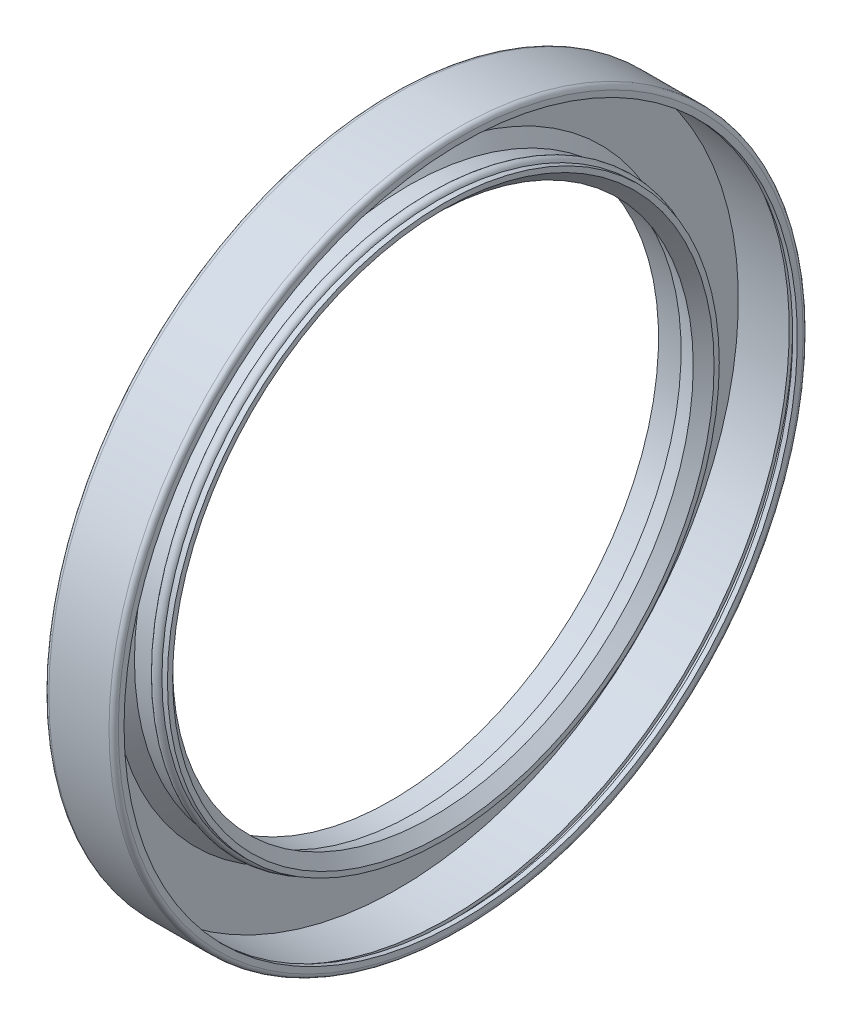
ISO-10303-21;
HEADER;
FILE_DESCRIPTION(('STEP AP214'),'2;1');
FILE_NAME('part.step','',(''),(''),'','','');
FILE_SCHEMA(('AUTOMOTIVE_DESIGN { 1 0 10303 214 1 1 1 1 }'));
ENDSEC;
DATA;
#1=APPLICATION_CONTEXT('core data for automotive mechanical design processes');
#2=APPLICATION_PROTOCOL_DEFINITION('international standard','automotive_design',2000,#1);
#3=PRODUCT_CONTEXT('',#1,'mechanical');
#4=PRODUCT('Part','Part','',(#3));
#5=PRODUCT_RELATED_PRODUCT_CATEGORY('part','',(#4));
#6=PRODUCT_DEFINITION_FORMATION('','',#4);
#7=PRODUCT_DEFINITION_CONTEXT('part definition',#1,'design');
#8=PRODUCT_DEFINITION('design','',#6,#7);
#9=PRODUCT_DEFINITION_SHAPE('','',#8);
#10=(LENGTH_UNIT() NAMED_UNIT(*) SI_UNIT(.MILLI.,.METRE.));
#11=(NAMED_UNIT(*) PLANE_ANGLE_UNIT() SI_UNIT($,.RADIAN.));
#12=(NAMED_UNIT(*) SI_UNIT($,.STERADIAN.) SOLID_ANGLE_UNIT());
#13=UNCERTAINTY_MEASURE_WITH_UNIT(LENGTH_MEASURE(1.E-05),#10,'distance_accuracy_value','');
#14=(GEOMETRIC_REPRESENTATION_CONTEXT(3) GLOBAL_UNCERTAINTY_ASSIGNED_CONTEXT((#13)) GLOBAL_UNIT_ASSIGNED_CONTEXT((#10,
#11,#12)) REPRESENTATION_CONTEXT('',''));
#15=CARTESIAN_POINT('',(0.,0.,0.));
#16=DIRECTION('',(0.,0.,1.));
#17=DIRECTION('',(1.,0.,0.));
#18=AXIS2_PLACEMENT_3D('',#15,#16,#17);
#19=CARTESIAN_POINT('',(0.,0.,-30.8));
#20=DIRECTION('',(1.,0.,0.));
#21=DIRECTION('',(0.,0.,-1.));
#22=AXIS2_PLACEMENT_3D('',#19,#20,#21);
#23=PLANE('',#22);
#24=CARTESIAN_POINT('',(0.,0.,0.));
#25=DIRECTION('',(-1.,0.,0.));
#26=DIRECTION('',(0.,0.,1.));
#27=AXIS2_PLACEMENT_3D('',#24,#25,#26);
#28=CIRCLE('',#27,39.4666666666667);
#29=CARTESIAN_POINT('',(0.,0.,39.4666666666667));
#30=VERTEX_POINT('',#29);
#31=EDGE_CURVE('E69',#30,#30,#28,.T.);
#32=ORIENTED_EDGE('',*,*,#31,.T.);
#33=EDGE_LOOP('',(#32));
#34=FACE_BOUND('',#33,.T.);
#35=CARTESIAN_POINT('',(0.,0.,0.));
#36=DIRECTION('',(1.,0.,0.));
#37=DIRECTION('',(0.,0.,-1.));
#38=AXIS2_PLACEMENT_3D('',#35,#36,#37);
#39=CIRCLE('',#38,31.2);
#40=CARTESIAN_POINT('',(0.,0.,-31.2));
#41=VERTEX_POINT('',#40);
#42=EDGE_CURVE('E10',#41,#41,#39,.F.);
#43=ORIENTED_EDGE('',*,*,#42,.F.);
#44=EDGE_LOOP('',(#43));
#45=FACE_BOUND('',#44,.T.);
#46=ADVANCED_FACE('F31',(#34,#45),#23,.F.);
#47=CARTESIAN_POINT('',(0.,0.,0.));
#48=DIRECTION('',(-1.,0.,0.));
#49=DIRECTION('',(0.,0.,1.));
#50=AXIS2_PLACEMENT_3D('',#47,#48,#49);
#51=CYLINDRICAL_SURFACE('',#50,39.2);
#52=CARTESIAN_POINT('',(6.66666666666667,0.,0.));
#53=DIRECTION('',(-1.,0.,0.));
#54=DIRECTION('',(0.,0.,1.));
#55=AXIS2_PLACEMENT_3D('',#52,#53,#54);
#56=CIRCLE('',#55,39.2);
#57=CARTESIAN_POINT('',(6.66666666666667,0.,39.2));
#58=VERTEX_POINT('',#57);
#59=EDGE_CURVE('E39',#58,#58,#56,.T.);
#60=ORIENTED_EDGE('',*,*,#59,.F.);
#61=EDGE_LOOP('',(#60));
#62=FACE_BOUND('',#61,.T.);
#63=CARTESIAN_POINT('',(0.799999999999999,0.,0.));
#64=DIRECTION('',(-1.,0.,0.));
#65=DIRECTION('',(0.,0.,1.));
#66=AXIS2_PLACEMENT_3D('',#63,#64,#65);
#67=CIRCLE('',#66,39.2);
#68=CARTESIAN_POINT('',(0.799999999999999,0.,39.2));
#69=VERTEX_POINT('',#68);
#70=EDGE_CURVE('E99',#69,#69,#67,.T.);
#71=ORIENTED_EDGE('',*,*,#70,.T.);
#72=EDGE_LOOP('',(#71));
#73=FACE_BOUND('',#72,.T.);
#74=ADVANCED_FACE('F33',(#62,#73),#51,.F.);
#75=CARTESIAN_POINT('',(6.66666666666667,0.,-39.2));
#76=DIRECTION('',(-1.,0.,0.));
#77=DIRECTION('',(0.,0.,1.));
#78=AXIS2_PLACEMENT_3D('',#75,#76,#77);
#79=PLANE('',#78);
#80=CARTESIAN_POINT('',(6.66666666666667,0.,0.));
#81=DIRECTION('',(-1.,0.,0.));
#82=DIRECTION('',(0.,0.,1.));
#83=AXIS2_PLACEMENT_3D('',#80,#81,#82);
#84=CIRCLE('',#83,39.6);
#85=CARTESIAN_POINT('',(6.66666666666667,0.,39.6));
#86=VERTEX_POINT('',#85);
#87=EDGE_CURVE('E45',#86,#86,#84,.T.);
#88=ORIENTED_EDGE('',*,*,#87,.F.);
#89=EDGE_LOOP('',(#88));
#90=FACE_BOUND('',#89,.T.);
#91=ORIENTED_EDGE('',*,*,#59,.T.);
#92=EDGE_LOOP('',(#91));
#93=FACE_BOUND('',#92,.T.);
#94=ADVANCED_FACE('F173',(#90,#93),#79,.F.);
#95=CARTESIAN_POINT('',(0.,0.,0.));
#96=DIRECTION('',(-1.,0.,0.));
#97=DIRECTION('',(0.,0.,1.));
#98=AXIS2_PLACEMENT_3D('',#95,#96,#97);
#99=CYLINDRICAL_SURFACE('',#98,39.6);
#100=CARTESIAN_POINT('',(7.46666666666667,0.,0.));
#101=DIRECTION('',(-1.,0.,0.));
#102=DIRECTION('',(0.,0.,1.));
#103=AXIS2_PLACEMENT_3D('',#100,#101,#102);
#104=CIRCLE('',#103,39.6);
#105=CARTESIAN_POINT('',(7.46666666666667,0.,39.6));
#106=VERTEX_POINT('',#105);
#107=EDGE_CURVE('E49',#106,#106,#104,.T.);
#108=ORIENTED_EDGE('',*,*,#107,.F.);
#109=EDGE_LOOP('',(#108));
#110=FACE_BOUND('',#109,.T.);
#111=ORIENTED_EDGE('',*,*,#87,.T.);
#112=EDGE_LOOP('',(#111));
#113=FACE_BOUND('',#112,.T.);
#114=ADVANCED_FACE('F206',(#110,#113),#99,.F.);
#115=CARTESIAN_POINT('',(7.46666666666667,0.,-39.6));
#116=DIRECTION('',(1.,0.,0.));
#117=DIRECTION('',(0.,0.,-1.));
#118=AXIS2_PLACEMENT_3D('',#115,#116,#117);
#119=PLANE('',#118);
#120=CARTESIAN_POINT('',(7.46666666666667,0.,0.));
#121=DIRECTION('',(-1.,0.,0.));
#122=DIRECTION('',(0.,0.,1.));
#123=AXIS2_PLACEMENT_3D('',#120,#121,#122);
#124=CIRCLE('',#123,38.8);
#125=CARTESIAN_POINT('',(7.46666666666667,0.,38.8));
#126=VERTEX_POINT('',#125);
#127=EDGE_CURVE('E54',#126,#126,#124,.T.);
#128=ORIENTED_EDGE('',*,*,#127,.F.);
#129=EDGE_LOOP('',(#128));
#130=FACE_BOUND('',#129,.T.);
#131=ORIENTED_EDGE('',*,*,#107,.T.);
#132=EDGE_LOOP('',(#131));
#133=FACE_BOUND('',#132,.T.);
#134=ADVANCED_FACE('F200',(#130,#133),#119,.F.);
#135=CARTESIAN_POINT('',(0.,0.,0.));
#136=DIRECTION('',(-1.,0.,0.));
#137=DIRECTION('',(0.,0.,1.));
#138=AXIS2_PLACEMENT_3D('',#135,#136,#137);
#139=CYLINDRICAL_SURFACE('',#138,38.8);
#140=CARTESIAN_POINT('',(8.,0.,0.));
#141=DIRECTION('',(-1.,0.,0.));
#142=DIRECTION('',(0.,0.,1.));
#143=AXIS2_PLACEMENT_3D('',#140,#141,#142);
#144=CIRCLE('',#143,38.8);
#145=CARTESIAN_POINT('',(8.,0.,38.8));
#146=VERTEX_POINT('',#145);
#147=EDGE_CURVE('E57',#146,#146,#144,.T.);
#148=ORIENTED_EDGE('',*,*,#147,.F.);
#149=EDGE_LOOP('',(#148));
#150=FACE_BOUND('',#149,.T.);
#151=ORIENTED_EDGE('',*,*,#127,.T.);
#152=EDGE_LOOP('',(#151));
#153=FACE_BOUND('',#152,.T.);
#154=ADVANCED_FACE('F194',(#150,#153),#139,.F.);
#155=CARTESIAN_POINT('',(8.,0.,-38.8));
#156=DIRECTION('',(-1.,0.,0.));
#157=DIRECTION('',(0.,0.,1.));
#158=AXIS2_PLACEMENT_3D('',#155,#156,#157);
#159=PLANE('',#158);
#160=CARTESIAN_POINT('',(8.,0.,0.));
#161=DIRECTION('',(-1.,0.,0.));
#162=DIRECTION('',(0.,0.,1.));
#163=AXIS2_PLACEMENT_3D('',#160,#161,#162);
#164=CIRCLE('',#163,39.4666666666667);
#165=CARTESIAN_POINT('',(8.,0.,39.4666666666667));
#166=VERTEX_POINT('',#165);
#167=EDGE_CURVE('E60',#166,#166,#164,.T.);
#168=ORIENTED_EDGE('',*,*,#167,.F.);
#169=EDGE_LOOP('',(#168));
#170=FACE_BOUND('',#169,.T.);
#171=ORIENTED_EDGE('',*,*,#147,.T.);
#172=EDGE_LOOP('',(#171));
#173=FACE_BOUND('',#172,.T.);
#174=ADVANCED_FACE('F188',(#170,#173),#159,.F.);
#175=CARTESIAN_POINT('',(7.46666666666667,0.,0.));
#176=DIRECTION('',(-1.,0.,0.));
#177=DIRECTION('',(0.,0.,1.));
#178=AXIS2_PLACEMENT_3D('',#175,#176,#177);
#179=TOROIDAL_SURFACE('',#178,39.4666666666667,0.533333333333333);
#180=CARTESIAN_POINT('',(7.46666666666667,0.,0.));
#181=DIRECTION('',(-1.,0.,0.));
#182=DIRECTION('',(0.,0.,1.));
#183=AXIS2_PLACEMENT_3D('',#180,#181,#182);
#184=CIRCLE('',#183,40.);
#185=CARTESIAN_POINT('',(7.46666666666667,0.,40.));
#186=VERTEX_POINT('',#185);
#187=EDGE_CURVE('E63',#186,#186,#184,.T.);
#188=ORIENTED_EDGE('',*,*,#187,.F.);
#189=EDGE_LOOP('',(#188));
#190=FACE_BOUND('',#189,.T.);
#191=ORIENTED_EDGE('',*,*,#167,.T.);
#192=EDGE_LOOP('',(#191));
#193=FACE_BOUND('',#192,.T.);
#194=ADVANCED_FACE('F182',(#190,#193),#179,.T.);
#195=CARTESIAN_POINT('',(0.,0.,0.));
#196=DIRECTION('',(-1.,0.,0.));
#197=DIRECTION('',(0.,0.,1.));
#198=AXIS2_PLACEMENT_3D('',#195,#196,#197);
#199=CYLINDRICAL_SURFACE('',#198,40.);
#200=CARTESIAN_POINT('',(0.533333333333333,0.,0.));
#201=DIRECTION('',(-1.,0.,0.));
#202=DIRECTION('',(0.,0.,1.));
#203=AXIS2_PLACEMENT_3D('',#200,#201,#202);
#204=CIRCLE('',#203,40.);
#205=CARTESIAN_POINT('',(0.533333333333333,0.,40.));
#206=VERTEX_POINT('',#205);
#207=EDGE_CURVE('E66',#206,#206,#204,.T.);
#208=ORIENTED_EDGE('',*,*,#207,.F.);
#209=EDGE_LOOP('',(#208));
#210=FACE_BOUND('',#209,.T.);
#211=ORIENTED_EDGE('',*,*,#187,.T.);
#212=EDGE_LOOP('',(#211));
#213=FACE_BOUND('',#212,.T.);
#214=ADVANCED_FACE('F165',(#210,#213),#199,.T.);
#215=CARTESIAN_POINT('',(0.533333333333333,0.,0.));
#216=DIRECTION('',(-1.,0.,0.));
#217=DIRECTION('',(0.,0.,1.));
#218=AXIS2_PLACEMENT_3D('',#215,#216,#217);
#219=TOROIDAL_SURFACE('',#218,39.4666666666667,0.533333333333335);
#220=ORIENTED_EDGE('',*,*,#31,.F.);
#221=EDGE_LOOP('',(#220));
#222=FACE_BOUND('',#221,.T.);
#223=ORIENTED_EDGE('',*,*,#207,.T.);
#224=EDGE_LOOP('',(#223));
#225=FACE_BOUND('',#224,.T.);
#226=ADVANCED_FACE('F160',(#222,#225),#219,.T.);
#227=ORIENTED_EDGE('',*,*,#42,.T.);
#228=EDGE_LOOP('',(#227));
#229=FACE_BOUND('',#228,.T.);
#230=CARTESIAN_POINT('',(0.,0.,0.));
#231=DIRECTION('',(-1.,0.,0.));
#232=DIRECTION('',(0.,0.,1.));
#233=AXIS2_PLACEMENT_3D('',#230,#231,#232);
#234=CIRCLE('',#233,30.8);
#235=CARTESIAN_POINT('',(0.,0.,30.8));
#236=VERTEX_POINT('',#235);
#237=EDGE_CURVE('E72',#236,#236,#234,.T.);
#238=ORIENTED_EDGE('',*,*,#237,.F.);
#239=EDGE_LOOP('',(#238));
#240=FACE_BOUND('',#239,.T.);
#241=ADVANCED_FACE('F155',(#229,#240),#23,.F.);
#242=CARTESIAN_POINT('',(0.,0.,0.));
#243=DIRECTION('',(-1.,0.,0.));
#244=DIRECTION('',(0.,0.,1.));
#245=AXIS2_PLACEMENT_3D('',#242,#243,#244);
#246=CYLINDRICAL_SURFACE('',#245,30.8);
#247=CARTESIAN_POINT('',(2.6020180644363,0.,0.));
#248=DIRECTION('',(-1.,0.,0.));
#249=DIRECTION('',(0.,0.,1.));
#250=AXIS2_PLACEMENT_3D('',#247,#248,#249);
#251=CIRCLE('',#250,30.8);
#252=CARTESIAN_POINT('',(2.6020180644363,0.,30.8));
#253=VERTEX_POINT('',#252);
#254=EDGE_CURVE('E75',#253,#253,#251,.T.);
#255=ORIENTED_EDGE('',*,*,#254,.F.);
#256=EDGE_LOOP('',(#255));
#257=FACE_BOUND('',#256,.T.);
#258=ORIENTED_EDGE('',*,*,#237,.T.);
#259=EDGE_LOOP('',(#258));
#260=FACE_BOUND('',#259,.T.);
#261=ADVANCED_FACE('F149',(#257,#260),#246,.F.);
#262=CARTESIAN_POINT('',(2.6020180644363,0.,0.));
#263=DIRECTION('',(-1.,0.,0.));
#264=DIRECTION('',(0.,0.,1.));
#265=AXIS2_PLACEMENT_3D('',#262,#263,#264);
#266=CONICAL_SURFACE('',#265,30.8,0.349065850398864);
#267=CARTESIAN_POINT('',(4.8,0.,0.));
#268=DIRECTION('',(-1.,0.,0.));
#269=DIRECTION('',(0.,0.,1.));
#270=AXIS2_PLACEMENT_3D('',#267,#268,#269);
#271=CIRCLE('',#270,30.);
#272=CARTESIAN_POINT('',(4.8,0.,30.));
#273=VERTEX_POINT('',#272);
#274=EDGE_CURVE('E78',#273,#273,#271,.T.);
#275=ORIENTED_EDGE('',*,*,#274,.F.);
#276=EDGE_LOOP('',(#275));
#277=FACE_BOUND('',#276,.T.);
#278=ORIENTED_EDGE('',*,*,#254,.T.);
#279=EDGE_LOOP('',(#278));
#280=FACE_BOUND('',#279,.T.);
#281=ADVANCED_FACE('F143',(#277,#280),#266,.F.);
#282=CARTESIAN_POINT('',(4.8,0.,0.));
#283=DIRECTION('',(1.,0.,0.));
#284=DIRECTION('',(0.,0.,-1.));
#285=AXIS2_PLACEMENT_3D('',#282,#283,#284);
#286=CONICAL_SURFACE('',#285,30.,0.785398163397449);
#287=CARTESIAN_POINT('',(6.,0.,0.));
#288=DIRECTION('',(-1.,0.,0.));
#289=DIRECTION('',(0.,0.,1.));
#290=AXIS2_PLACEMENT_3D('',#287,#288,#289);
#291=CIRCLE('',#290,31.2);
#292=CARTESIAN_POINT('',(6.,0.,31.2));
#293=VERTEX_POINT('',#292);
#294=EDGE_CURVE('E81',#293,#293,#291,.T.);
#295=ORIENTED_EDGE('',*,*,#294,.F.);
#296=EDGE_LOOP('',(#295));
#297=FACE_BOUND('',#296,.T.);
#298=ORIENTED_EDGE('',*,*,#274,.T.);
#299=EDGE_LOOP('',(#298));
#300=FACE_BOUND('',#299,.T.);
#301=ADVANCED_FACE('F137',(#297,#300),#286,.F.);
#302=CARTESIAN_POINT('',(6.,0.,-31.2));
#303=DIRECTION('',(-1.,0.,0.));
#304=DIRECTION('',(0.,0.,1.));
#305=AXIS2_PLACEMENT_3D('',#302,#303,#304);
#306=PLANE('',#305);
#307=CARTESIAN_POINT('',(6.,0.,0.));
#308=DIRECTION('',(-1.,0.,0.));
#309=DIRECTION('',(0.,0.,1.));
#310=AXIS2_PLACEMENT_3D('',#307,#308,#309);
#311=CIRCLE('',#310,31.8);
#312=CARTESIAN_POINT('',(6.,0.,31.8));
#313=VERTEX_POINT('',#312);
#314=EDGE_CURVE('E84',#313,#313,#311,.T.);
#315=ORIENTED_EDGE('',*,*,#314,.F.);
#316=EDGE_LOOP('',(#315));
#317=FACE_BOUND('',#316,.T.);
#318=ORIENTED_EDGE('',*,*,#294,.T.);
#319=EDGE_LOOP('',(#318));
#320=FACE_BOUND('',#319,.T.);
#321=ADVANCED_FACE('F131',(#317,#320),#306,.F.);
#322=CARTESIAN_POINT('',(0.,0.,0.));
#323=DIRECTION('',(-1.,0.,0.));
#324=DIRECTION('',(0.,0.,1.));
#325=AXIS2_PLACEMENT_3D('',#322,#323,#324);
#326=CYLINDRICAL_SURFACE('',#325,31.8);
#327=CARTESIAN_POINT('',(5.36568542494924,0.,0.));
#328=DIRECTION('',(-1.,0.,0.));
#329=DIRECTION('',(0.,0.,1.));
#330=AXIS2_PLACEMENT_3D('',#327,#328,#329);
#331=CIRCLE('',#330,31.8);
#332=CARTESIAN_POINT('',(5.36568542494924,0.,31.8));
#333=VERTEX_POINT('',#332);
#334=EDGE_CURVE('E87',#333,#333,#331,.T.);
#335=ORIENTED_EDGE('',*,*,#334,.F.);
#336=EDGE_LOOP('',(#335));
#337=FACE_BOUND('',#336,.T.);
#338=ORIENTED_EDGE('',*,*,#314,.T.);
#339=EDGE_LOOP('',(#338));
#340=FACE_BOUND('',#339,.T.);
#341=ADVANCED_FACE('F125',(#337,#340),#326,.T.);
#342=CARTESIAN_POINT('',(4.8,0.,0.));
#343=DIRECTION('',(-1.,0.,0.));
#344=DIRECTION('',(0.,0.,1.));
#345=AXIS2_PLACEMENT_3D('',#342,#343,#344);
#346=TOROIDAL_SURFACE('',#345,31.6,0.6);
#347=CARTESIAN_POINT('',(4.2,0.,0.));
#348=DIRECTION('',(-1.,0.,0.));
#349=DIRECTION('',(0.,0.,1.));
#350=AXIS2_PLACEMENT_3D('',#347,#348,#349);
#351=CIRCLE('',#350,31.6);
#352=CARTESIAN_POINT('',(4.2,0.,31.6));
#353=VERTEX_POINT('',#352);
#354=EDGE_CURVE('E90',#353,#353,#351,.T.);
#355=ORIENTED_EDGE('',*,*,#354,.F.);
#356=EDGE_LOOP('',(#355));
#357=FACE_BOUND('',#356,.T.);
#358=ORIENTED_EDGE('',*,*,#334,.T.);
#359=EDGE_LOOP('',(#358));
#360=FACE_BOUND('',#359,.T.);
#361=ADVANCED_FACE('F119',(#357,#360),#346,.T.);
#362=CARTESIAN_POINT('',(0.,0.,0.));
#363=DIRECTION('',(-1.,0.,0.));
#364=DIRECTION('',(0.,0.,1.));
#365=AXIS2_PLACEMENT_3D('',#362,#363,#364);
#366=CYLINDRICAL_SURFACE('',#365,31.6);
#367=CARTESIAN_POINT('',(2.,0.,0.));
#368=DIRECTION('',(-1.,0.,0.));
#369=DIRECTION('',(0.,0.,1.));
#370=AXIS2_PLACEMENT_3D('',#367,#368,#369);
#371=CIRCLE('',#370,31.6);
#372=CARTESIAN_POINT('',(2.,0.,31.6));
#373=VERTEX_POINT('',#372);
#374=EDGE_CURVE('E93',#373,#373,#371,.T.);
#375=ORIENTED_EDGE('',*,*,#374,.F.);
#376=EDGE_LOOP('',(#375));
#377=FACE_BOUND('',#376,.T.);
#378=ORIENTED_EDGE('',*,*,#354,.T.);
#379=EDGE_LOOP('',(#378));
#380=FACE_BOUND('',#379,.T.);
#381=ADVANCED_FACE('F113',(#377,#380),#366,.T.);
#382=CARTESIAN_POINT('',(2.,0.,0.));
#383=DIRECTION('',(-1.,0.,0.));
#384=DIRECTION('',(0.,0.,1.));
#385=AXIS2_PLACEMENT_3D('',#382,#383,#384);
#386=CONICAL_SURFACE('',#385,31.6,0.872664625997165);
#387=CARTESIAN_POINT('',(0.8,0.,0.));
#388=DIRECTION('',(-1.,0.,0.));
#389=DIRECTION('',(0.,0.,1.));
#390=AXIS2_PLACEMENT_3D('',#387,#388,#389);
#391=CIRCLE('',#390,33.030104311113);
#392=CARTESIAN_POINT('',(0.8,0.,33.030104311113));
#393=VERTEX_POINT('',#392);
#394=EDGE_CURVE('E96',#393,#393,#391,.T.);
#395=ORIENTED_EDGE('',*,*,#394,.F.);
#396=EDGE_LOOP('',(#395));
#397=FACE_BOUND('',#396,.T.);
#398=ORIENTED_EDGE('',*,*,#374,.T.);
#399=EDGE_LOOP('',(#398));
#400=FACE_BOUND('',#399,.T.);
#401=ADVANCED_FACE('F107',(#397,#400),#386,.T.);
#402=CARTESIAN_POINT('',(0.8,0.,-39.2));
#403=DIRECTION('',(-1.,0.,0.));
#404=DIRECTION('',(0.,0.,1.));
#405=AXIS2_PLACEMENT_3D('',#402,#403,#404);
#406=PLANE('',#405);
#407=ORIENTED_EDGE('',*,*,#70,.F.);
#408=EDGE_LOOP('',(#407));
#409=FACE_BOUND('',#408,.T.);
#410=ORIENTED_EDGE('',*,*,#394,.T.);
#411=EDGE_LOOP('',(#410));
#412=FACE_BOUND('',#411,.T.);
#413=ADVANCED_FACE('F104',(#409,#412),#406,.F.);
#414=CLOSED_SHELL('',(#46,#74,#94,#114,#134,#154,#174,#194,#214,#226,#241,#261,#281,#301,#321,
#341,#361,#381,#401,#413));
#415=MANIFOLD_SOLID_BREP('B2',#414);
#416=ADVANCED_BREP_SHAPE_REPRESENTATION('',(#18,#415),#14);
#417=SHAPE_DEFINITION_REPRESENTATION(#9,#416);
ENDSEC;
END-ISO-10303-21;
